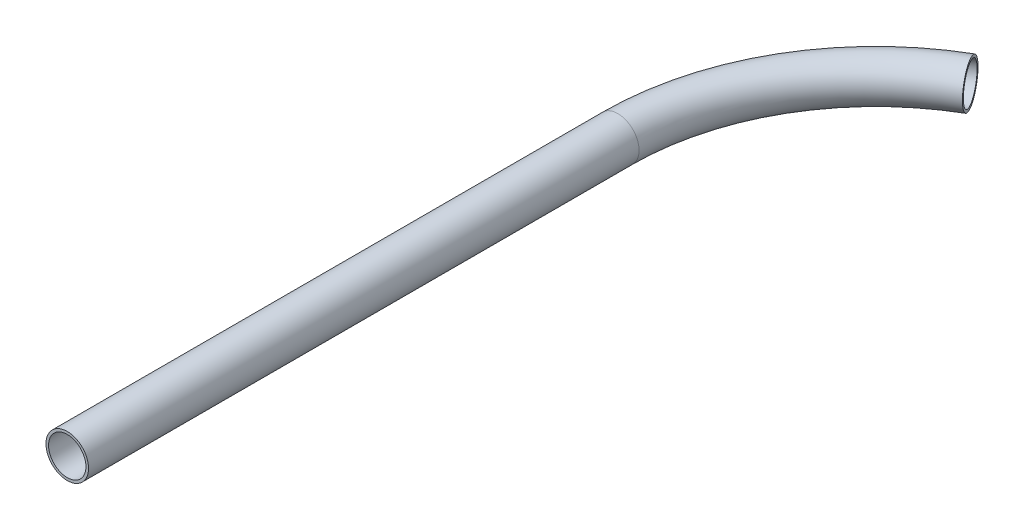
ISO-10303-21;
HEADER;
FILE_DESCRIPTION(('STEP AP214'),'2;1');
FILE_NAME('part.step','',(''),(''),'','','');
FILE_SCHEMA(('AUTOMOTIVE_DESIGN { 1 0 10303 214 1 1 1 1 }'));
ENDSEC;
DATA;
#1=APPLICATION_CONTEXT('core data for automotive mechanical design processes');
#2=APPLICATION_PROTOCOL_DEFINITION('international standard','automotive_design',2000,#1);
#3=PRODUCT_CONTEXT('',#1,'mechanical');
#4=PRODUCT('Part','Part','',(#3));
#5=PRODUCT_RELATED_PRODUCT_CATEGORY('part','',(#4));
#6=PRODUCT_DEFINITION_FORMATION('','',#4);
#7=PRODUCT_DEFINITION_CONTEXT('part definition',#1,'design');
#8=PRODUCT_DEFINITION('design','',#6,#7);
#9=PRODUCT_DEFINITION_SHAPE('','',#8);
#10=(LENGTH_UNIT() NAMED_UNIT(*) SI_UNIT(.MILLI.,.METRE.));
#11=(NAMED_UNIT(*) PLANE_ANGLE_UNIT() SI_UNIT($,.RADIAN.));
#12=(NAMED_UNIT(*) SI_UNIT($,.STERADIAN.) SOLID_ANGLE_UNIT());
#13=UNCERTAINTY_MEASURE_WITH_UNIT(LENGTH_MEASURE(1.E-05),#10,'distance_accuracy_value','');
#14=(GEOMETRIC_REPRESENTATION_CONTEXT(3) GLOBAL_UNCERTAINTY_ASSIGNED_CONTEXT((#13)) GLOBAL_UNIT_ASSIGNED_CONTEXT((#10,
#11,#12)) REPRESENTATION_CONTEXT('',''));
#15=CARTESIAN_POINT('',(0.,0.,0.));
#16=DIRECTION('',(0.,0.,1.));
#17=DIRECTION('',(1.,0.,0.));
#18=AXIS2_PLACEMENT_3D('',#15,#16,#17);
#19=CARTESIAN_POINT('',(0.,0.,0.));
#20=DIRECTION('',(0.,0.,-1.));
#21=DIRECTION('',(-1.,0.,0.));
#22=AXIS2_PLACEMENT_3D('',#19,#20,#21);
#23=CYLINDRICAL_SURFACE('',#22,16.5);
#24=CARTESIAN_POINT('',(0.,0.,-426.794919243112));
#25=DIRECTION('',(0.,0.,1.));
#26=DIRECTION('',(1.,0.,0.));
#27=AXIS2_PLACEMENT_3D('',#24,#25,#26);
#28=CIRCLE('',#27,16.5);
#29=CARTESIAN_POINT('',(16.5,0.,-426.794919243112));
#30=VERTEX_POINT('',#29);
#31=EDGE_CURVE('E36',#30,#30,#28,.T.);
#32=ORIENTED_EDGE('',*,*,#31,.T.);
#33=EDGE_LOOP('',(#32));
#34=FACE_BOUND('',#33,.T.);
#35=CARTESIAN_POINT('',(0.,0.,0.));
#36=DIRECTION('',(0.,0.,1.));
#37=DIRECTION('',(1.,0.,0.));
#38=AXIS2_PLACEMENT_3D('',#35,#36,#37);
#39=CIRCLE('',#38,16.5);
#40=CARTESIAN_POINT('',(16.5,0.,0.));
#41=VERTEX_POINT('',#40);
#42=EDGE_CURVE('E47',#41,#41,#39,.T.);
#43=ORIENTED_EDGE('',*,*,#42,.F.);
#44=EDGE_LOOP('',(#43));
#45=FACE_BOUND('',#44,.T.);
#46=ADVANCED_FACE('F32',(#34,#45),#23,.T.);
#47=CARTESIAN_POINT('',(200.,0.,-426.794919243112));
#48=DIRECTION('',(0.,-1.,0.));
#49=DIRECTION('',(0.,0.,-1.));
#50=AXIS2_PLACEMENT_3D('',#47,#48,#49);
#51=TOROIDAL_SURFACE('',#50,200.,16.5);
#52=CARTESIAN_POINT('',(100.,0.,-600.));
#53=DIRECTION('',(-0.86602540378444,0.,0.499999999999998));
#54=DIRECTION('',(0.499999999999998,0.,0.866025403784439));
#55=AXIS2_PLACEMENT_3D('',#52,#53,#54);
#56=CIRCLE('',#55,16.5);
#57=CARTESIAN_POINT('',(108.25,0.,-585.710580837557));
#58=VERTEX_POINT('',#57);
#59=EDGE_CURVE('E52',#58,#58,#56,.T.);
#60=ORIENTED_EDGE('',*,*,#59,.T.);
#61=EDGE_LOOP('',(#60));
#62=FACE_BOUND('',#61,.T.);
#63=ORIENTED_EDGE('',*,*,#31,.F.);
#64=EDGE_LOOP('',(#63));
#65=FACE_BOUND('',#64,.T.);
#66=ADVANCED_FACE('F34',(#62,#65),#51,.T.);
#67=CARTESIAN_POINT('',(0.,0.,0.));
#68=DIRECTION('',(0.,0.,1.));
#69=DIRECTION('',(1.,0.,0.));
#70=AXIS2_PLACEMENT_3D('',#67,#68,#69);
#71=PLANE('',#70);
#72=CARTESIAN_POINT('',(0.,0.,0.));
#73=DIRECTION('',(0.,0.,1.));
#74=DIRECTION('',(1.,0.,0.));
#75=AXIS2_PLACEMENT_3D('',#72,#73,#74);
#76=CIRCLE('',#75,14.5);
#77=CARTESIAN_POINT('',(14.5,0.,0.));
#78=VERTEX_POINT('',#77);
#79=EDGE_CURVE('E116',#78,#78,#76,.F.);
#80=ORIENTED_EDGE('',*,*,#79,.T.);
#81=EDGE_LOOP('',(#80));
#82=FACE_BOUND('',#81,.T.);
#83=ORIENTED_EDGE('',*,*,#42,.T.);
#84=EDGE_LOOP('',(#83));
#85=FACE_BOUND('',#84,.T.);
#86=ADVANCED_FACE('F65',(#82,#85),#71,.T.);
#87=CARTESIAN_POINT('',(100.,0.,-600.));
#88=DIRECTION('',(-0.86602540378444,0.,0.499999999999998));
#89=DIRECTION('',(0.499999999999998,0.,0.866025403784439));
#90=AXIS2_PLACEMENT_3D('',#87,#88,#89);
#91=PLANE('',#90);
#92=CARTESIAN_POINT('',(100.,0.,-600.));
#93=DIRECTION('',(-0.86602540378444,0.,0.499999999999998));
#94=DIRECTION('',(0.499999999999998,0.,0.866025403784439));
#95=AXIS2_PLACEMENT_3D('',#92,#93,#94);
#96=CIRCLE('',#95,14.5);
#97=CARTESIAN_POINT('',(107.25,0.,-587.442631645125));
#98=VERTEX_POINT('',#97);
#99=EDGE_CURVE('E11',#98,#98,#96,.F.);
#100=ORIENTED_EDGE('',*,*,#99,.F.);
#101=EDGE_LOOP('',(#100));
#102=FACE_BOUND('',#101,.T.);
#103=ORIENTED_EDGE('',*,*,#59,.F.);
#104=EDGE_LOOP('',(#103));
#105=FACE_BOUND('',#104,.T.);
#106=ADVANCED_FACE('F62',(#102,#105),#91,.F.);
#107=CARTESIAN_POINT('',(0.,0.,0.));
#108=DIRECTION('',(0.,0.,-1.));
#109=DIRECTION('',(-1.,0.,0.));
#110=AXIS2_PLACEMENT_3D('',#107,#108,#109);
#111=CYLINDRICAL_SURFACE('',#110,14.5);
#112=CARTESIAN_POINT('',(0.,0.,-426.794919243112));
#113=DIRECTION('',(0.,0.,1.));
#114=DIRECTION('',(1.,0.,0.));
#115=AXIS2_PLACEMENT_3D('',#112,#113,#114);
#116=CIRCLE('',#115,14.5);
#117=CARTESIAN_POINT('',(14.5,0.,-426.794919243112));
#118=VERTEX_POINT('',#117);
#119=EDGE_CURVE('E41',#118,#118,#116,.F.);
#120=ORIENTED_EDGE('',*,*,#119,.T.);
#121=EDGE_LOOP('',(#120));
#122=FACE_BOUND('',#121,.T.);
#123=ORIENTED_EDGE('',*,*,#79,.F.);
#124=EDGE_LOOP('',(#123));
#125=FACE_BOUND('',#124,.T.);
#126=ADVANCED_FACE('F64',(#122,#125),#111,.F.);
#127=CARTESIAN_POINT('',(200.,0.,-426.794919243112));
#128=DIRECTION('',(0.,-1.,0.));
#129=DIRECTION('',(0.,0.,-1.));
#130=AXIS2_PLACEMENT_3D('',#127,#128,#129);
#131=TOROIDAL_SURFACE('',#130,200.,14.5);
#132=ORIENTED_EDGE('',*,*,#99,.T.);
#133=EDGE_LOOP('',(#132));
#134=FACE_BOUND('',#133,.T.);
#135=ORIENTED_EDGE('',*,*,#119,.F.);
#136=EDGE_LOOP('',(#135));
#137=FACE_BOUND('',#136,.T.);
#138=ADVANCED_FACE('F59',(#134,#137),#131,.F.);
#139=CLOSED_SHELL('',(#46,#66,#86,#106,#126,#138));
#140=MANIFOLD_SOLID_BREP('B2',#139);
#141=ADVANCED_BREP_SHAPE_REPRESENTATION('',(#18,#140),#14);
#142=SHAPE_DEFINITION_REPRESENTATION(#9,#141);
ENDSEC;
END-ISO-10303-21;
